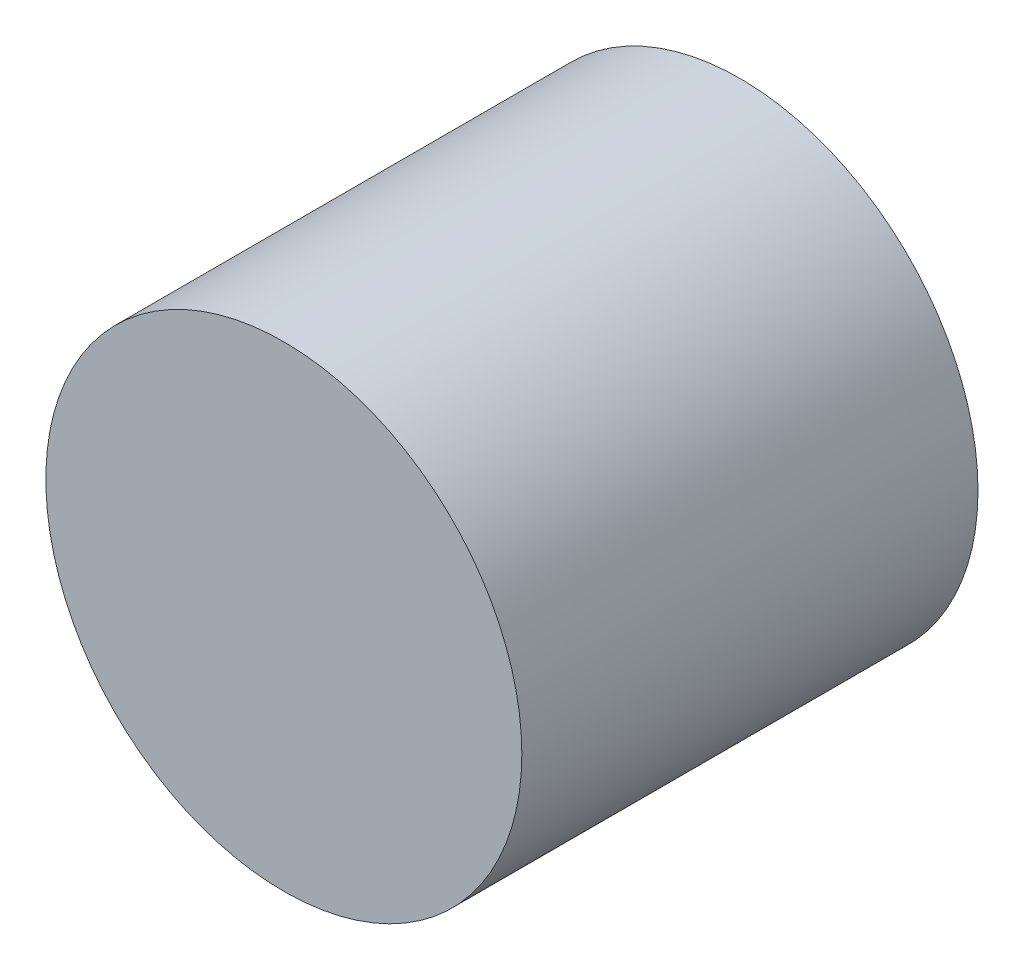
ISO-10303-21;
HEADER;
FILE_DESCRIPTION(('STEP AP214'),'2;1');
FILE_NAME('part.step','',(''),(''),'','','');
FILE_SCHEMA(('AUTOMOTIVE_DESIGN { 1 0 10303 214 1 1 1 1 }'));
ENDSEC;
DATA;
#1=APPLICATION_CONTEXT('core data for automotive mechanical design processes');
#2=APPLICATION_PROTOCOL_DEFINITION('international standard','automotive_design',2000,#1);
#3=PRODUCT_CONTEXT('',#1,'mechanical');
#4=PRODUCT('Part','Part','',(#3));
#5=PRODUCT_RELATED_PRODUCT_CATEGORY('part','',(#4));
#6=PRODUCT_DEFINITION_FORMATION('','',#4);
#7=PRODUCT_DEFINITION_CONTEXT('part definition',#1,'design');
#8=PRODUCT_DEFINITION('design','',#6,#7);
#9=PRODUCT_DEFINITION_SHAPE('','',#8);
#10=(LENGTH_UNIT() NAMED_UNIT(*) SI_UNIT(.MILLI.,.METRE.));
#11=(NAMED_UNIT(*) PLANE_ANGLE_UNIT() SI_UNIT($,.RADIAN.));
#12=(NAMED_UNIT(*) SI_UNIT($,.STERADIAN.) SOLID_ANGLE_UNIT());
#13=UNCERTAINTY_MEASURE_WITH_UNIT(LENGTH_MEASURE(1.E-05),#10,'distance_accuracy_value','');
#14=(GEOMETRIC_REPRESENTATION_CONTEXT(3) GLOBAL_UNCERTAINTY_ASSIGNED_CONTEXT((#13)) GLOBAL_UNIT_ASSIGNED_CONTEXT((#10,
#11,#12)) REPRESENTATION_CONTEXT('',''));
#15=CARTESIAN_POINT('',(0.,0.,0.));
#16=DIRECTION('',(0.,0.,1.));
#17=DIRECTION('',(1.,0.,0.));
#18=AXIS2_PLACEMENT_3D('',#15,#16,#17);
#19=CARTESIAN_POINT('',(0.,0.,0.));
#20=DIRECTION('',(0.,0.,1.));
#21=DIRECTION('',(1.,0.,0.));
#22=AXIS2_PLACEMENT_3D('',#19,#20,#21);
#23=PLANE('',#22);
#24=CARTESIAN_POINT('',(0.,0.,0.));
#25=DIRECTION('',(0.,0.,1.));
#26=DIRECTION('',(1.,0.,0.));
#27=AXIS2_PLACEMENT_3D('',#24,#25,#26);
#28=CIRCLE('',#27,12.);
#29=CARTESIAN_POINT('',(12.,0.,0.));
#30=VERTEX_POINT('',#29);
#31=EDGE_CURVE('E16',#30,#30,#28,.T.);
#32=ORIENTED_EDGE('',*,*,#31,.F.);
#33=EDGE_LOOP('',(#32));
#34=FACE_BOUND('',#33,.T.);
#35=ADVANCED_FACE('F12',(#34),#23,.F.);
#36=CARTESIAN_POINT('',(0.,0.,23.));
#37=DIRECTION('',(0.,0.,-1.));
#38=DIRECTION('',(-1.,0.,0.));
#39=AXIS2_PLACEMENT_3D('',#36,#37,#38);
#40=CYLINDRICAL_SURFACE('',#39,12.);
#41=CARTESIAN_POINT('',(0.,0.,23.));
#42=DIRECTION('',(0.,0.,1.));
#43=DIRECTION('',(1.,0.,0.));
#44=AXIS2_PLACEMENT_3D('',#41,#42,#43);
#45=CIRCLE('',#44,12.);
#46=CARTESIAN_POINT('',(12.,0.,23.));
#47=VERTEX_POINT('',#46);
#48=EDGE_CURVE('E8',#47,#47,#45,.T.);
#49=ORIENTED_EDGE('',*,*,#48,.F.);
#50=EDGE_LOOP('',(#49));
#51=FACE_BOUND('',#50,.T.);
#52=ORIENTED_EDGE('',*,*,#31,.T.);
#53=EDGE_LOOP('',(#52));
#54=FACE_BOUND('',#53,.T.);
#55=ADVANCED_FACE('F14',(#51,#54),#40,.T.);
#56=CARTESIAN_POINT('',(0.,0.,23.));
#57=DIRECTION('',(0.,0.,1.));
#58=DIRECTION('',(1.,0.,0.));
#59=AXIS2_PLACEMENT_3D('',#56,#57,#58);
#60=PLANE('',#59);
#61=ORIENTED_EDGE('',*,*,#48,.T.);
#62=EDGE_LOOP('',(#61));
#63=FACE_BOUND('',#62,.T.);
#64=ADVANCED_FACE('F32',(#63),#60,.T.);
#65=CLOSED_SHELL('',(#35,#55,#64));
#66=MANIFOLD_SOLID_BREP('B1',#65);
#67=ADVANCED_BREP_SHAPE_REPRESENTATION('',(#18,#66),#14);
#68=SHAPE_DEFINITION_REPRESENTATION(#9,#67);
ENDSEC;
END-ISO-10303-21;
